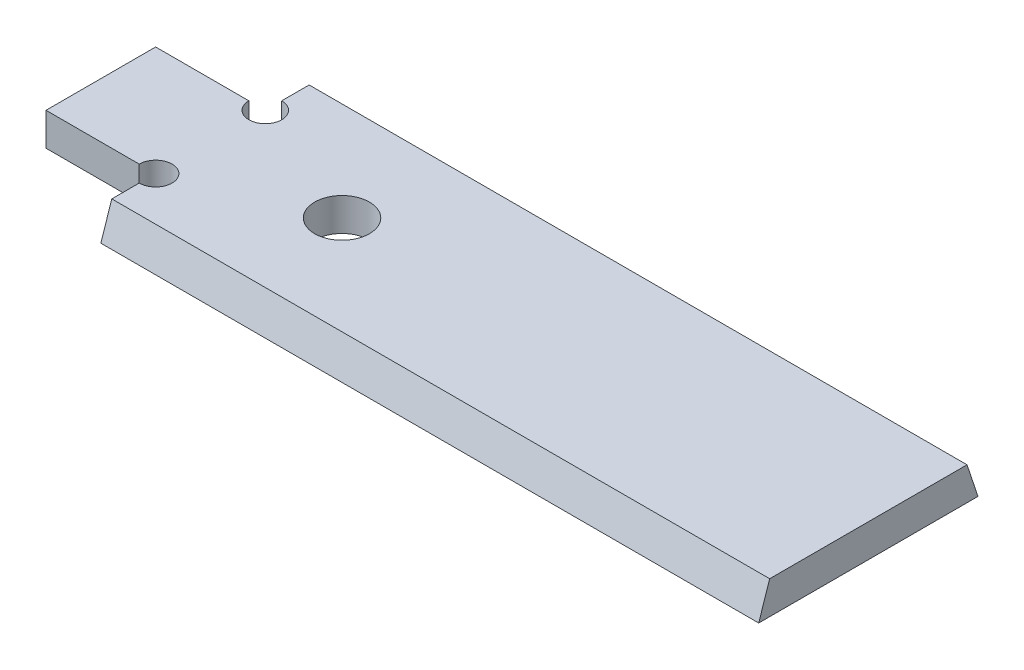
ISO-10303-21;
HEADER;
FILE_DESCRIPTION(('STEP AP214'),'2;1');
FILE_NAME('part.step','',(''),(''),'','','');
FILE_SCHEMA(('AUTOMOTIVE_DESIGN { 1 0 10303 214 1 1 1 1 }'));
ENDSEC;
DATA;
#1=APPLICATION_CONTEXT('core data for automotive mechanical design processes');
#2=APPLICATION_PROTOCOL_DEFINITION('international standard','automotive_design',2000,#1);
#3=PRODUCT_CONTEXT('',#1,'mechanical');
#4=PRODUCT('Part','Part','',(#3));
#5=PRODUCT_RELATED_PRODUCT_CATEGORY('part','',(#4));
#6=PRODUCT_DEFINITION_FORMATION('','',#4);
#7=PRODUCT_DEFINITION_CONTEXT('part definition',#1,'design');
#8=PRODUCT_DEFINITION('design','',#6,#7);
#9=PRODUCT_DEFINITION_SHAPE('','',#8);
#10=(LENGTH_UNIT() NAMED_UNIT(*) SI_UNIT(.MILLI.,.METRE.));
#11=(NAMED_UNIT(*) PLANE_ANGLE_UNIT() SI_UNIT($,.RADIAN.));
#12=(NAMED_UNIT(*) SI_UNIT($,.STERADIAN.) SOLID_ANGLE_UNIT());
#13=UNCERTAINTY_MEASURE_WITH_UNIT(LENGTH_MEASURE(1.E-05),#10,'distance_accuracy_value','');
#14=(GEOMETRIC_REPRESENTATION_CONTEXT(3) GLOBAL_UNCERTAINTY_ASSIGNED_CONTEXT((#13)) GLOBAL_UNIT_ASSIGNED_CONTEXT((#10,
#11,#12)) REPRESENTATION_CONTEXT('',''));
#15=CARTESIAN_POINT('',(0.,0.,0.));
#16=DIRECTION('',(0.,0.,1.));
#17=DIRECTION('',(1.,0.,0.));
#18=AXIS2_PLACEMENT_3D('',#15,#16,#17);
#19=CARTESIAN_POINT('',(10.,3.,-15.));
#20=DIRECTION('',(0.,1.,0.));
#21=DIRECTION('',(0.,0.,1.));
#22=AXIS2_PLACEMENT_3D('',#19,#20,#21);
#23=PLANE('',#22);
#24=DIRECTION('',(1.,0.,0.));
#25=VECTOR('',#24,1.);
#26=CARTESIAN_POINT('',(0.,3.,-19.));
#27=LINE('',#26,#25);
#28=CARTESIAN_POINT('',(10.,3.,-19.));
#29=VERTEX_POINT('',#28);
#30=CARTESIAN_POINT('',(70.,3.,-19.));
#31=VERTEX_POINT('',#30);
#32=EDGE_CURVE('E113',#29,#31,#27,.T.);
#33=ORIENTED_EDGE('',*,*,#32,.F.);
#34=DIRECTION('',(0.,0.,1.));
#35=VECTOR('',#34,1.);
#36=CARTESIAN_POINT('',(10.,3.,-16.5));
#37=LINE('',#36,#35);
#38=CARTESIAN_POINT('',(10.,3.,-16.5));
#39=VERTEX_POINT('',#38);
#40=EDGE_CURVE('E156',#29,#39,#37,.T.);
#41=ORIENTED_EDGE('',*,*,#40,.T.);
#42=CARTESIAN_POINT('',(10.,3.,-15.));
#43=DIRECTION('',(0.,-1.,0.));
#44=DIRECTION('',(0.,0.,1.));
#45=AXIS2_PLACEMENT_3D('',#42,#43,#44);
#46=CIRCLE('',#45,1.5);
#47=CARTESIAN_POINT('',(8.5,3.,-15.));
#48=VERTEX_POINT('',#47);
#49=EDGE_CURVE('E158',#39,#48,#46,.T.);
#50=ORIENTED_EDGE('',*,*,#49,.T.);
#51=DIRECTION('',(-1.,0.,0.));
#52=VECTOR('',#51,1.);
#53=CARTESIAN_POINT('',(0.,3.,-15.));
#54=LINE('',#53,#52);
#55=CARTESIAN_POINT('',(0.,3.,-15.));
#56=VERTEX_POINT('',#55);
#57=EDGE_CURVE('E160',#48,#56,#54,.T.);
#58=ORIENTED_EDGE('',*,*,#57,.T.);
#59=DIRECTION('',(0.,0.,1.));
#60=VECTOR('',#59,1.);
#61=CARTESIAN_POINT('',(0.,3.,-5.));
#62=LINE('',#61,#60);
#63=CARTESIAN_POINT('',(0.,3.,-5.));
#64=VERTEX_POINT('',#63);
#65=EDGE_CURVE('E162',#56,#64,#62,.T.);
#66=ORIENTED_EDGE('',*,*,#65,.T.);
#67=DIRECTION('',(1.,0.,0.));
#68=VECTOR('',#67,1.);
#69=CARTESIAN_POINT('',(0.,3.,-5.));
#70=LINE('',#69,#68);
#71=CARTESIAN_POINT('',(8.5,3.,-5.));
#72=VERTEX_POINT('',#71);
#73=EDGE_CURVE('E52',#64,#72,#70,.T.);
#74=ORIENTED_EDGE('',*,*,#73,.T.);
#75=CARTESIAN_POINT('',(10.,3.,-5.));
#76=DIRECTION('',(0.,-1.,0.));
#77=DIRECTION('',(0.,0.,1.));
#78=AXIS2_PLACEMENT_3D('',#75,#76,#77);
#79=CIRCLE('',#78,1.5);
#80=CARTESIAN_POINT('',(10.,3.,-3.5));
#81=VERTEX_POINT('',#80);
#82=EDGE_CURVE('E47',#72,#81,#79,.T.);
#83=ORIENTED_EDGE('',*,*,#82,.T.);
#84=DIRECTION('',(0.,0.,1.));
#85=VECTOR('',#84,1.);
#86=CARTESIAN_POINT('',(10.,3.,0.));
#87=LINE('',#86,#85);
#88=CARTESIAN_POINT('',(10.,3.,-1.));
#89=VERTEX_POINT('',#88);
#90=EDGE_CURVE('E166',#81,#89,#87,.T.);
#91=ORIENTED_EDGE('',*,*,#90,.T.);
#92=DIRECTION('',(1.,0.,0.));
#93=VECTOR('',#92,1.);
#94=CARTESIAN_POINT('',(0.,3.,-1.));
#95=LINE('',#94,#93);
#96=CARTESIAN_POINT('',(70.,3.,-1.));
#97=VERTEX_POINT('',#96);
#98=EDGE_CURVE('E322',#89,#97,#95,.T.);
#99=ORIENTED_EDGE('',*,*,#98,.T.);
#100=DIRECTION('',(0.,0.,-1.));
#101=VECTOR('',#100,1.);
#102=CARTESIAN_POINT('',(70.,3.,0.));
#103=LINE('',#102,#101);
#104=EDGE_CURVE('E154',#97,#31,#103,.T.);
#105=ORIENTED_EDGE('',*,*,#104,.T.);
#106=EDGE_LOOP('',(#33,#41,#50,#58,#66,#74,#83,#91,#99,#105));
#107=FACE_BOUND('',#106,.T.);
#108=CARTESIAN_POINT('',(22.,3.,-10.));
#109=DIRECTION('',(0.,1.,0.));
#110=DIRECTION('',(0.,0.,1.));
#111=AXIS2_PLACEMENT_3D('',#108,#109,#110);
#112=CIRCLE('',#111,2.5);
#113=CARTESIAN_POINT('',(22.,3.,-7.5));
#114=VERTEX_POINT('',#113);
#115=EDGE_CURVE('E131',#114,#114,#112,.T.);
#116=ORIENTED_EDGE('',*,*,#115,.F.);
#117=EDGE_LOOP('',(#116));
#118=FACE_BOUND('',#117,.T.);
#119=ADVANCED_FACE('F32',(#107,#118),#23,.T.);
#120=CARTESIAN_POINT('',(10.,0.,-15.));
#121=DIRECTION('',(0.,1.,0.));
#122=DIRECTION('',(0.,0.,1.));
#123=AXIS2_PLACEMENT_3D('',#120,#121,#122);
#124=PLANE('',#123);
#125=DIRECTION('',(0.,0.,-1.));
#126=VECTOR('',#125,1.);
#127=CARTESIAN_POINT('',(70.,0.,0.));
#128=LINE('',#127,#126);
#129=CARTESIAN_POINT('',(70.,0.,0.));
#130=VERTEX_POINT('',#129);
#131=CARTESIAN_POINT('',(70.,0.,-20.));
#132=VERTEX_POINT('',#131);
#133=EDGE_CURVE('E125',#130,#132,#128,.T.);
#134=ORIENTED_EDGE('',*,*,#133,.F.);
#135=DIRECTION('',(1.,0.,0.));
#136=VECTOR('',#135,1.);
#137=CARTESIAN_POINT('',(10.,0.,0.));
#138=LINE('',#137,#136);
#139=CARTESIAN_POINT('',(10.,0.,0.));
#140=VERTEX_POINT('',#139);
#141=EDGE_CURVE('E152',#140,#130,#138,.T.);
#142=ORIENTED_EDGE('',*,*,#141,.F.);
#143=DIRECTION('',(0.,0.,1.));
#144=VECTOR('',#143,1.);
#145=CARTESIAN_POINT('',(10.,0.,0.));
#146=LINE('',#145,#144);
#147=CARTESIAN_POINT('',(10.,0.,-3.5));
#148=VERTEX_POINT('',#147);
#149=EDGE_CURVE('E149',#148,#140,#146,.T.);
#150=ORIENTED_EDGE('',*,*,#149,.F.);
#151=CARTESIAN_POINT('',(10.,0.,-5.));
#152=DIRECTION('',(0.,-1.,0.));
#153=DIRECTION('',(0.,0.,1.));
#154=AXIS2_PLACEMENT_3D('',#151,#152,#153);
#155=CIRCLE('',#154,1.5);
#156=CARTESIAN_POINT('',(8.5,0.,-5.));
#157=VERTEX_POINT('',#156);
#158=EDGE_CURVE('E147',#157,#148,#155,.T.);
#159=ORIENTED_EDGE('',*,*,#158,.F.);
#160=DIRECTION('',(1.,0.,0.));
#161=VECTOR('',#160,1.);
#162=CARTESIAN_POINT('',(0.,0.,-5.));
#163=LINE('',#162,#161);
#164=CARTESIAN_POINT('',(0.,0.,-5.));
#165=VERTEX_POINT('',#164);
#166=EDGE_CURVE('E145',#165,#157,#163,.T.);
#167=ORIENTED_EDGE('',*,*,#166,.F.);
#168=DIRECTION('',(0.,0.,1.));
#169=VECTOR('',#168,1.);
#170=CARTESIAN_POINT('',(0.,0.,-5.));
#171=LINE('',#170,#169);
#172=CARTESIAN_POINT('',(0.,0.,-15.));
#173=VERTEX_POINT('',#172);
#174=EDGE_CURVE('E143',#173,#165,#171,.T.);
#175=ORIENTED_EDGE('',*,*,#174,.F.);
#176=DIRECTION('',(-1.,0.,0.));
#177=VECTOR('',#176,1.);
#178=CARTESIAN_POINT('',(0.,0.,-15.));
#179=LINE('',#178,#177);
#180=CARTESIAN_POINT('',(8.5,0.,-15.));
#181=VERTEX_POINT('',#180);
#182=EDGE_CURVE('E141',#181,#173,#179,.T.);
#183=ORIENTED_EDGE('',*,*,#182,.F.);
#184=CARTESIAN_POINT('',(10.,0.,-15.));
#185=DIRECTION('',(0.,-1.,0.));
#186=DIRECTION('',(0.,0.,1.));
#187=AXIS2_PLACEMENT_3D('',#184,#185,#186);
#188=CIRCLE('',#187,1.5);
#189=CARTESIAN_POINT('',(10.,0.,-16.5));
#190=VERTEX_POINT('',#189);
#191=EDGE_CURVE('E139',#190,#181,#188,.T.);
#192=ORIENTED_EDGE('',*,*,#191,.F.);
#193=DIRECTION('',(0.,0.,1.));
#194=VECTOR('',#193,1.);
#195=CARTESIAN_POINT('',(10.,0.,-16.5));
#196=LINE('',#195,#194);
#197=CARTESIAN_POINT('',(10.,0.,-20.));
#198=VERTEX_POINT('',#197);
#199=EDGE_CURVE('E127',#198,#190,#196,.T.);
#200=ORIENTED_EDGE('',*,*,#199,.F.);
#201=DIRECTION('',(-1.,0.,0.));
#202=VECTOR('',#201,1.);
#203=CARTESIAN_POINT('',(10.,0.,-20.));
#204=LINE('',#203,#202);
#205=EDGE_CURVE('E111',#132,#198,#204,.T.);
#206=ORIENTED_EDGE('',*,*,#205,.F.);
#207=EDGE_LOOP('',(#134,#142,#150,#159,#167,#175,#183,#192,#200,#206));
#208=FACE_BOUND('',#207,.T.);
#209=CARTESIAN_POINT('',(22.,0.,-10.));
#210=DIRECTION('',(0.,1.,0.));
#211=DIRECTION('',(0.,0.,1.));
#212=AXIS2_PLACEMENT_3D('',#209,#210,#211);
#213=CIRCLE('',#212,2.5);
#214=CARTESIAN_POINT('',(22.,0.,-7.5));
#215=VERTEX_POINT('',#214);
#216=EDGE_CURVE('E134',#215,#215,#213,.T.);
#217=ORIENTED_EDGE('',*,*,#216,.T.);
#218=EDGE_LOOP('',(#217));
#219=FACE_BOUND('',#218,.T.);
#220=ADVANCED_FACE('F122',(#208,#219),#124,.F.);
#221=CARTESIAN_POINT('',(70.,3.,0.));
#222=DIRECTION('',(-1.,0.,0.));
#223=DIRECTION('',(0.,0.,1.));
#224=AXIS2_PLACEMENT_3D('',#221,#222,#223);
#225=PLANE('',#224);
#226=ORIENTED_EDGE('',*,*,#133,.T.);
#227=DIRECTION('',(0.,-0.948683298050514,-0.316227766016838));
#228=VECTOR('',#227,1.);
#229=CARTESIAN_POINT('',(70.,3.,-19.));
#230=LINE('',#229,#228);
#231=EDGE_CURVE('E108',#31,#132,#230,.T.);
#232=ORIENTED_EDGE('',*,*,#231,.F.);
#233=ORIENTED_EDGE('',*,*,#104,.F.);
#234=DIRECTION('',(0.,0.948683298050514,-0.316227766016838));
#235=VECTOR('',#234,1.);
#236=CARTESIAN_POINT('',(70.,3.,-1.));
#237=LINE('',#236,#235);
#238=EDGE_CURVE('E130',#130,#97,#237,.T.);
#239=ORIENTED_EDGE('',*,*,#238,.F.);
#240=EDGE_LOOP('',(#226,#232,#233,#239));
#241=FACE_BOUND('',#240,.T.);
#242=ADVANCED_FACE('F34',(#241),#225,.F.);
#243=CARTESIAN_POINT('',(10.,3.,-16.5));
#244=DIRECTION('',(1.,0.,0.));
#245=DIRECTION('',(0.,0.,-1.));
#246=AXIS2_PLACEMENT_3D('',#243,#244,#245);
#247=PLANE('',#246);
#248=ORIENTED_EDGE('',*,*,#40,.F.);
#249=DIRECTION('',(0.,-0.948683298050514,-0.316227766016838));
#250=VECTOR('',#249,1.);
#251=CARTESIAN_POINT('',(10.,3.75,-18.75));
#252=LINE('',#251,#250);
#253=EDGE_CURVE('E11',#29,#198,#252,.T.);
#254=ORIENTED_EDGE('',*,*,#253,.T.);
#255=ORIENTED_EDGE('',*,*,#199,.T.);
#256=DIRECTION('',(0.,-1.,0.));
#257=VECTOR('',#256,1.);
#258=CARTESIAN_POINT('',(10.,3.,-16.5));
#259=LINE('',#258,#257);
#260=EDGE_CURVE('E40',#39,#190,#259,.T.);
#261=ORIENTED_EDGE('',*,*,#260,.F.);
#262=EDGE_LOOP('',(#248,#254,#255,#261));
#263=FACE_BOUND('',#262,.T.);
#264=ADVANCED_FACE('F202',(#263),#247,.F.);
#265=CARTESIAN_POINT('',(10.,3.,-15.));
#266=DIRECTION('',(0.,-1.,0.));
#267=DIRECTION('',(0.,0.,-1.));
#268=AXIS2_PLACEMENT_3D('',#265,#266,#267);
#269=CYLINDRICAL_SURFACE('',#268,1.5);
#270=ORIENTED_EDGE('',*,*,#191,.T.);
#271=DIRECTION('',(0.,-1.,0.));
#272=VECTOR('',#271,1.);
#273=CARTESIAN_POINT('',(8.5,3.,-15.));
#274=LINE('',#273,#272);
#275=EDGE_CURVE('E180',#48,#181,#274,.T.);
#276=ORIENTED_EDGE('',*,*,#275,.F.);
#277=ORIENTED_EDGE('',*,*,#49,.F.);
#278=ORIENTED_EDGE('',*,*,#260,.T.);
#279=EDGE_LOOP('',(#270,#276,#277,#278));
#280=FACE_BOUND('',#279,.T.);
#281=ADVANCED_FACE('F186',(#280),#269,.F.);
#282=CARTESIAN_POINT('',(0.,3.,-15.));
#283=DIRECTION('',(0.,0.,1.));
#284=DIRECTION('',(1.,0.,0.));
#285=AXIS2_PLACEMENT_3D('',#282,#283,#284);
#286=PLANE('',#285);
#287=ORIENTED_EDGE('',*,*,#182,.T.);
#288=DIRECTION('',(0.,-1.,0.));
#289=VECTOR('',#288,1.);
#290=CARTESIAN_POINT('',(0.,3.,-15.));
#291=LINE('',#290,#289);
#292=EDGE_CURVE('E177',#56,#173,#291,.T.);
#293=ORIENTED_EDGE('',*,*,#292,.F.);
#294=ORIENTED_EDGE('',*,*,#57,.F.);
#295=ORIENTED_EDGE('',*,*,#275,.T.);
#296=EDGE_LOOP('',(#287,#293,#294,#295));
#297=FACE_BOUND('',#296,.T.);
#298=ADVANCED_FACE('F195',(#297),#286,.F.);
#299=CARTESIAN_POINT('',(0.,3.,-5.));
#300=DIRECTION('',(1.,0.,0.));
#301=DIRECTION('',(0.,0.,-1.));
#302=AXIS2_PLACEMENT_3D('',#299,#300,#301);
#303=PLANE('',#302);
#304=ORIENTED_EDGE('',*,*,#174,.T.);
#305=DIRECTION('',(0.,-1.,0.));
#306=VECTOR('',#305,1.);
#307=CARTESIAN_POINT('',(0.,3.,-5.));
#308=LINE('',#307,#306);
#309=EDGE_CURVE('E174',#64,#165,#308,.T.);
#310=ORIENTED_EDGE('',*,*,#309,.F.);
#311=ORIENTED_EDGE('',*,*,#65,.F.);
#312=ORIENTED_EDGE('',*,*,#292,.T.);
#313=EDGE_LOOP('',(#304,#310,#311,#312));
#314=FACE_BOUND('',#313,.T.);
#315=ADVANCED_FACE('F199',(#314),#303,.F.);
#316=CARTESIAN_POINT('',(0.,3.,-5.));
#317=DIRECTION('',(0.,0.,-1.));
#318=DIRECTION('',(-1.,0.,0.));
#319=AXIS2_PLACEMENT_3D('',#316,#317,#318);
#320=PLANE('',#319);
#321=ORIENTED_EDGE('',*,*,#166,.T.);
#322=DIRECTION('',(0.,-1.,0.));
#323=VECTOR('',#322,1.);
#324=CARTESIAN_POINT('',(8.5,3.,-5.));
#325=LINE('',#324,#323);
#326=EDGE_CURVE('E171',#72,#157,#325,.T.);
#327=ORIENTED_EDGE('',*,*,#326,.F.);
#328=ORIENTED_EDGE('',*,*,#73,.F.);
#329=ORIENTED_EDGE('',*,*,#309,.T.);
#330=EDGE_LOOP('',(#321,#327,#328,#329));
#331=FACE_BOUND('',#330,.T.);
#332=ADVANCED_FACE('F225',(#331),#320,.F.);
#333=CARTESIAN_POINT('',(10.,3.,-5.));
#334=DIRECTION('',(0.,-1.,0.));
#335=DIRECTION('',(0.,0.,-1.));
#336=AXIS2_PLACEMENT_3D('',#333,#334,#335);
#337=CYLINDRICAL_SURFACE('',#336,1.5);
#338=ORIENTED_EDGE('',*,*,#158,.T.);
#339=DIRECTION('',(0.,-1.,0.));
#340=VECTOR('',#339,1.);
#341=CARTESIAN_POINT('',(10.,3.,-3.5));
#342=LINE('',#341,#340);
#343=EDGE_CURVE('E168',#81,#148,#342,.T.);
#344=ORIENTED_EDGE('',*,*,#343,.F.);
#345=ORIENTED_EDGE('',*,*,#82,.F.);
#346=ORIENTED_EDGE('',*,*,#326,.T.);
#347=EDGE_LOOP('',(#338,#344,#345,#346));
#348=FACE_BOUND('',#347,.T.);
#349=ADVANCED_FACE('F221',(#348),#337,.F.);
#350=CARTESIAN_POINT('',(10.,3.,0.));
#351=DIRECTION('',(1.,0.,0.));
#352=DIRECTION('',(0.,0.,-1.));
#353=AXIS2_PLACEMENT_3D('',#350,#351,#352);
#354=PLANE('',#353);
#355=ORIENTED_EDGE('',*,*,#149,.T.);
#356=DIRECTION('',(0.,0.948683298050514,-0.316227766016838));
#357=VECTOR('',#356,1.);
#358=CARTESIAN_POINT('',(10.,2.7,-0.9));
#359=LINE('',#358,#357);
#360=EDGE_CURVE('E318',#140,#89,#359,.T.);
#361=ORIENTED_EDGE('',*,*,#360,.T.);
#362=ORIENTED_EDGE('',*,*,#90,.F.);
#363=ORIENTED_EDGE('',*,*,#343,.T.);
#364=EDGE_LOOP('',(#355,#361,#362,#363));
#365=FACE_BOUND('',#364,.T.);
#366=ADVANCED_FACE('F217',(#365),#354,.F.);
#367=CARTESIAN_POINT('',(22.,3.,-10.));
#368=DIRECTION('',(0.,-1.,0.));
#369=DIRECTION('',(0.,0.,-1.));
#370=AXIS2_PLACEMENT_3D('',#367,#368,#369);
#371=CYLINDRICAL_SURFACE('',#370,2.5);
#372=ORIENTED_EDGE('',*,*,#115,.T.);
#373=EDGE_LOOP('',(#372));
#374=FACE_BOUND('',#373,.T.);
#375=ORIENTED_EDGE('',*,*,#216,.F.);
#376=EDGE_LOOP('',(#375));
#377=FACE_BOUND('',#376,.T.);
#378=ADVANCED_FACE('F220',(#374,#377),#371,.F.);
#379=CARTESIAN_POINT('',(0.,3.,-1.));
#380=DIRECTION('',(0.,-0.316227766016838,-0.948683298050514));
#381=DIRECTION('',(0.,0.948683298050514,-0.316227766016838));
#382=AXIS2_PLACEMENT_3D('',#379,#380,#381);
#383=PLANE('',#382);
#384=ORIENTED_EDGE('',*,*,#141,.T.);
#385=ORIENTED_EDGE('',*,*,#238,.T.);
#386=ORIENTED_EDGE('',*,*,#98,.F.);
#387=ORIENTED_EDGE('',*,*,#360,.F.);
#388=EDGE_LOOP('',(#384,#385,#386,#387));
#389=FACE_BOUND('',#388,.T.);
#390=ADVANCED_FACE('F261',(#389),#383,.F.);
#391=CARTESIAN_POINT('',(0.,3.,-19.));
#392=DIRECTION('',(0.,-0.316227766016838,0.948683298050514));
#393=DIRECTION('',(0.,-0.948683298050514,-0.316227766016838));
#394=AXIS2_PLACEMENT_3D('',#391,#392,#393);
#395=PLANE('',#394);
#396=ORIENTED_EDGE('',*,*,#32,.T.);
#397=ORIENTED_EDGE('',*,*,#231,.T.);
#398=ORIENTED_EDGE('',*,*,#205,.T.);
#399=ORIENTED_EDGE('',*,*,#253,.F.);
#400=EDGE_LOOP('',(#396,#397,#398,#399));
#401=FACE_BOUND('',#400,.T.);
#402=ADVANCED_FACE('F110',(#401),#395,.F.);
#403=CLOSED_SHELL('',(#119,#220,#242,#264,#281,#298,#315,#332,#349,#366,#378,#390,#402));
#404=MANIFOLD_SOLID_BREP('B2',#403);
#405=ADVANCED_BREP_SHAPE_REPRESENTATION('',(#18,#404),#14);
#406=SHAPE_DEFINITION_REPRESENTATION(#9,#405);
ENDSEC;
END-ISO-10303-21;
